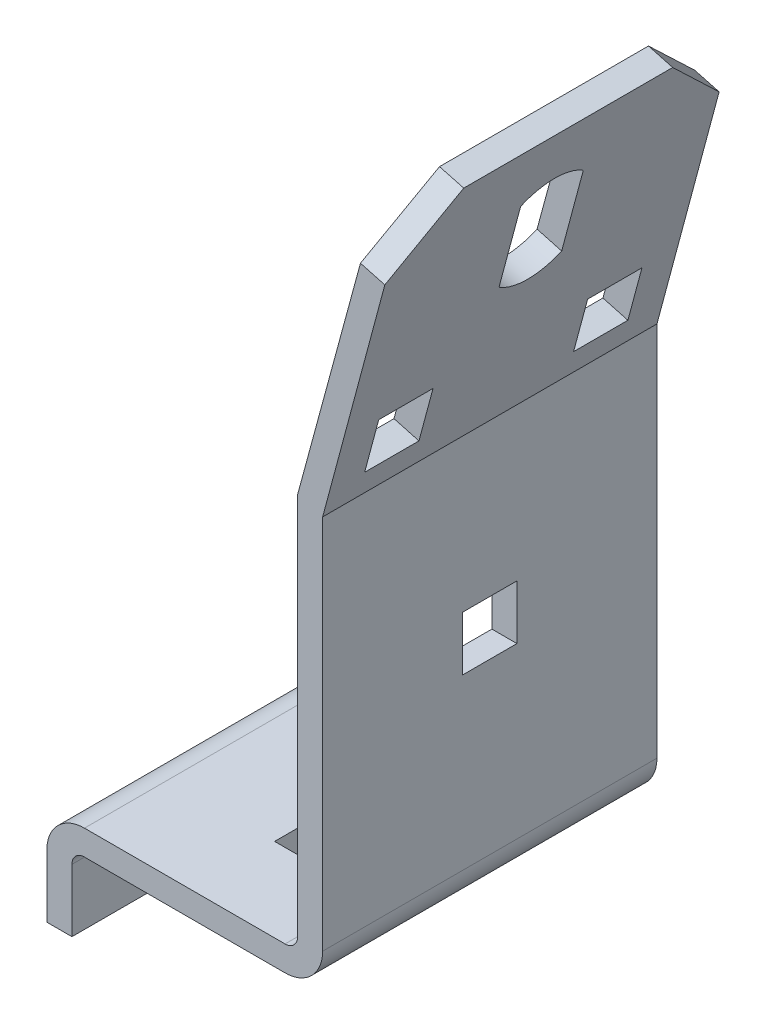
ISO-10303-21;
HEADER;
FILE_DESCRIPTION(('STEP AP214'),'2;1');
FILE_NAME('part.step','',(''),(''),'','','');
FILE_SCHEMA(('AUTOMOTIVE_DESIGN { 1 0 10303 214 1 1 1 1 }'));
ENDSEC;
DATA;
#1=APPLICATION_CONTEXT('core data for automotive mechanical design processes');
#2=APPLICATION_PROTOCOL_DEFINITION('international standard','automotive_design',2000,#1);
#3=PRODUCT_CONTEXT('',#1,'mechanical');
#4=PRODUCT('Part','Part','',(#3));
#5=PRODUCT_RELATED_PRODUCT_CATEGORY('part','',(#4));
#6=PRODUCT_DEFINITION_FORMATION('','',#4);
#7=PRODUCT_DEFINITION_CONTEXT('part definition',#1,'design');
#8=PRODUCT_DEFINITION('design','',#6,#7);
#9=PRODUCT_DEFINITION_SHAPE('','',#8);
#10=(LENGTH_UNIT() NAMED_UNIT(*) SI_UNIT(.MILLI.,.METRE.));
#11=(NAMED_UNIT(*) PLANE_ANGLE_UNIT() SI_UNIT($,.RADIAN.));
#12=(NAMED_UNIT(*) SI_UNIT($,.STERADIAN.) SOLID_ANGLE_UNIT());
#13=UNCERTAINTY_MEASURE_WITH_UNIT(LENGTH_MEASURE(1.E-05),#10,'distance_accuracy_value','');
#14=(GEOMETRIC_REPRESENTATION_CONTEXT(3) GLOBAL_UNCERTAINTY_ASSIGNED_CONTEXT((#13)) GLOBAL_UNIT_ASSIGNED_CONTEXT((#10,
#11,#12)) REPRESENTATION_CONTEXT('',''));
#15=CARTESIAN_POINT('',(0.,0.,0.));
#16=DIRECTION('',(0.,0.,1.));
#17=DIRECTION('',(1.,0.,0.));
#18=AXIS2_PLACEMENT_3D('',#15,#16,#17);
#19=CARTESIAN_POINT('',(0.,15.,-80.));
#20=DIRECTION('',(-1.,0.,0.));
#21=DIRECTION('',(0.,0.,1.));
#22=AXIS2_PLACEMENT_3D('',#19,#20,#21);
#23=PLANE('',#22);
#24=DIRECTION('',(0.,-1.,0.));
#25=VECTOR('',#24,1.);
#26=CARTESIAN_POINT('',(0.,15.,0.));
#27=LINE('',#26,#25);
#28=CARTESIAN_POINT('',(0.,15.,0.));
#29=VERTEX_POINT('',#28);
#30=CARTESIAN_POINT('',(0.,0.,0.));
#31=VERTEX_POINT('',#30);
#32=EDGE_CURVE('E409',#29,#31,#27,.T.);
#33=ORIENTED_EDGE('',*,*,#32,.F.);
#34=DIRECTION('',(0.,0.,1.));
#35=VECTOR('',#34,1.);
#36=CARTESIAN_POINT('',(0.,15.,-80.));
#37=LINE('',#36,#35);
#38=CARTESIAN_POINT('',(0.,15.,-80.));
#39=VERTEX_POINT('',#38);
#40=EDGE_CURVE('E446',#39,#29,#37,.T.);
#41=ORIENTED_EDGE('',*,*,#40,.F.);
#42=DIRECTION('',(0.,-1.,0.));
#43=VECTOR('',#42,1.);
#44=CARTESIAN_POINT('',(0.,0.,-80.));
#45=LINE('',#44,#43);
#46=CARTESIAN_POINT('',(0.,0.,-80.));
#47=VERTEX_POINT('',#46);
#48=EDGE_CURVE('E411',#39,#47,#45,.T.);
#49=ORIENTED_EDGE('',*,*,#48,.T.);
#50=DIRECTION('',(0.,0.,1.));
#51=VECTOR('',#50,1.);
#52=CARTESIAN_POINT('',(0.,0.,-80.));
#53=LINE('',#52,#51);
#54=EDGE_CURVE('E445',#47,#31,#53,.T.);
#55=ORIENTED_EDGE('',*,*,#54,.T.);
#56=EDGE_LOOP('',(#33,#41,#49,#55));
#57=FACE_BOUND('',#56,.T.);
#58=ADVANCED_FACE('F34',(#57),#23,.T.);
#59=CARTESIAN_POINT('',(9.,15.,-80.));
#60=DIRECTION('',(0.,0.,1.));
#61=DIRECTION('',(1.,0.,0.));
#62=AXIS2_PLACEMENT_3D('',#59,#60,#61);
#63=CYLINDRICAL_SURFACE('',#62,9.);
#64=CARTESIAN_POINT('',(9.,15.,0.));
#65=DIRECTION('',(0.,0.,1.));
#66=DIRECTION('',(1.,0.,0.));
#67=AXIS2_PLACEMENT_3D('',#64,#65,#66);
#68=CIRCLE('',#67,9.);
#69=CARTESIAN_POINT('',(9.,24.,0.));
#70=VERTEX_POINT('',#69);
#71=EDGE_CURVE('E406',#70,#29,#68,.T.);
#72=ORIENTED_EDGE('',*,*,#71,.F.);
#73=DIRECTION('',(0.,0.,1.));
#74=VECTOR('',#73,1.);
#75=CARTESIAN_POINT('',(9.,24.,-80.));
#76=LINE('',#75,#74);
#77=CARTESIAN_POINT('',(9.,24.,-80.));
#78=VERTEX_POINT('',#77);
#79=EDGE_CURVE('E449',#78,#70,#76,.T.);
#80=ORIENTED_EDGE('',*,*,#79,.F.);
#81=CARTESIAN_POINT('',(9.,15.,-80.));
#82=DIRECTION('',(0.,0.,1.));
#83=DIRECTION('',(1.,0.,0.));
#84=AXIS2_PLACEMENT_3D('',#81,#82,#83);
#85=CIRCLE('',#84,9.);
#86=EDGE_CURVE('E442',#78,#39,#85,.T.);
#87=ORIENTED_EDGE('',*,*,#86,.T.);
#88=ORIENTED_EDGE('',*,*,#40,.T.);
#89=EDGE_LOOP('',(#72,#80,#87,#88));
#90=FACE_BOUND('',#89,.T.);
#91=ADVANCED_FACE('F559',(#90),#63,.T.);
#92=CARTESIAN_POINT('',(12.0000000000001,24.,-80.));
#93=DIRECTION('',(0.,1.,0.));
#94=DIRECTION('',(0.,0.,1.));
#95=AXIS2_PLACEMENT_3D('',#92,#93,#94);
#96=PLANE('',#95);
#97=DIRECTION('',(0.,0.,-1.));
#98=VECTOR('',#97,1.);
#99=CARTESIAN_POINT('',(47.5,24.,-60.));
#100=LINE('',#99,#98);
#101=CARTESIAN_POINT('',(47.5,24.,-20.));
#102=VERTEX_POINT('',#101);
#103=CARTESIAN_POINT('',(47.5,24.,-60.));
#104=VERTEX_POINT('',#103);
#105=EDGE_CURVE('E49',#102,#104,#100,.T.);
#106=ORIENTED_EDGE('',*,*,#105,.F.);
#107=DIRECTION('',(1.,0.,0.));
#108=VECTOR('',#107,1.);
#109=CARTESIAN_POINT('',(47.5,24.,-20.));
#110=LINE('',#109,#108);
#111=CARTESIAN_POINT('',(34.5,24.,-20.));
#112=VERTEX_POINT('',#111);
#113=EDGE_CURVE('E285',#112,#102,#110,.T.);
#114=ORIENTED_EDGE('',*,*,#113,.F.);
#115=DIRECTION('',(0.,0.,1.));
#116=VECTOR('',#115,1.);
#117=CARTESIAN_POINT('',(34.5,24.,-60.));
#118=LINE('',#117,#116);
#119=CARTESIAN_POINT('',(34.5,24.,-60.));
#120=VERTEX_POINT('',#119);
#121=EDGE_CURVE('E269',#120,#112,#118,.T.);
#122=ORIENTED_EDGE('',*,*,#121,.F.);
#123=DIRECTION('',(-1.,0.,0.));
#124=VECTOR('',#123,1.);
#125=CARTESIAN_POINT('',(47.5,24.,-60.));
#126=LINE('',#125,#124);
#127=EDGE_CURVE('E278',#104,#120,#126,.T.);
#128=ORIENTED_EDGE('',*,*,#127,.F.);
#129=EDGE_LOOP('',(#106,#114,#122,#128));
#130=FACE_BOUND('',#129,.T.);
#131=DIRECTION('',(-1.,0.,0.));
#132=VECTOR('',#131,1.);
#133=CARTESIAN_POINT('',(12.0000000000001,24.,0.));
#134=LINE('',#133,#132);
#135=CARTESIAN_POINT('',(57.,24.,0.));
#136=VERTEX_POINT('',#135);
#137=EDGE_CURVE('E403',#136,#70,#134,.T.);
#138=ORIENTED_EDGE('',*,*,#137,.F.);
#139=DIRECTION('',(0.,0.,1.));
#140=VECTOR('',#139,1.);
#141=CARTESIAN_POINT('',(57.,24.,-80.));
#142=LINE('',#141,#140);
#143=CARTESIAN_POINT('',(57.,24.,-80.));
#144=VERTEX_POINT('',#143);
#145=EDGE_CURVE('E451',#144,#136,#142,.T.);
#146=ORIENTED_EDGE('',*,*,#145,.F.);
#147=DIRECTION('',(-1.,0.,0.));
#148=VECTOR('',#147,1.);
#149=CARTESIAN_POINT('',(48.,24.,-80.));
#150=LINE('',#149,#148);
#151=EDGE_CURVE('E440',#144,#78,#150,.T.);
#152=ORIENTED_EDGE('',*,*,#151,.T.);
#153=ORIENTED_EDGE('',*,*,#79,.T.);
#154=EDGE_LOOP('',(#138,#146,#152,#153));
#155=FACE_BOUND('',#154,.T.);
#156=ADVANCED_FACE('F282',(#130,#155),#96,.T.);
#157=CARTESIAN_POINT('',(57.,27.,-80.));
#158=DIRECTION('',(0.,0.,1.));
#159=DIRECTION('',(1.,0.,0.));
#160=AXIS2_PLACEMENT_3D('',#157,#158,#159);
#161=CYLINDRICAL_SURFACE('',#160,3.);
#162=CARTESIAN_POINT('',(57.,27.,0.));
#163=DIRECTION('',(0.,0.,-1.));
#164=DIRECTION('',(1.,0.,0.));
#165=AXIS2_PLACEMENT_3D('',#162,#163,#164);
#166=CIRCLE('',#165,3.);
#167=CARTESIAN_POINT('',(60.,27.,0.));
#168=VERTEX_POINT('',#167);
#169=EDGE_CURVE('E400',#168,#136,#166,.T.);
#170=ORIENTED_EDGE('',*,*,#169,.F.);
#171=DIRECTION('',(0.,0.,1.));
#172=VECTOR('',#171,1.);
#173=CARTESIAN_POINT('',(60.,27.,-80.));
#174=LINE('',#173,#172);
#175=CARTESIAN_POINT('',(60.,27.,-80.));
#176=VERTEX_POINT('',#175);
#177=EDGE_CURVE('E454',#176,#168,#174,.T.);
#178=ORIENTED_EDGE('',*,*,#177,.F.);
#179=CARTESIAN_POINT('',(57.,27.,-80.));
#180=DIRECTION('',(0.,0.,-1.));
#181=DIRECTION('',(1.,0.,0.));
#182=AXIS2_PLACEMENT_3D('',#179,#180,#181);
#183=CIRCLE('',#182,3.);
#184=EDGE_CURVE('E437',#176,#144,#183,.T.);
#185=ORIENTED_EDGE('',*,*,#184,.T.);
#186=ORIENTED_EDGE('',*,*,#145,.T.);
#187=EDGE_LOOP('',(#170,#178,#185,#186));
#188=FACE_BOUND('',#187,.T.);
#189=ADVANCED_FACE('F574',(#188),#161,.F.);
#190=CARTESIAN_POINT('',(60.,30.,-80.));
#191=DIRECTION('',(-1.,0.,0.));
#192=DIRECTION('',(0.,0.,1.));
#193=AXIS2_PLACEMENT_3D('',#190,#191,#192);
#194=PLANE('',#193);
#195=DIRECTION('',(0.,1.,0.));
#196=VECTOR('',#195,1.);
#197=CARTESIAN_POINT('',(60.,80.5,-33.5));
#198=LINE('',#197,#196);
#199=CARTESIAN_POINT('',(60.,67.5,-33.5));
#200=VERTEX_POINT('',#199);
#201=CARTESIAN_POINT('',(60.,80.5,-33.5));
#202=VERTEX_POINT('',#201);
#203=EDGE_CURVE('E292',#200,#202,#198,.T.);
#204=ORIENTED_EDGE('',*,*,#203,.F.);
#205=DIRECTION('',(0.,0.,1.));
#206=VECTOR('',#205,1.);
#207=CARTESIAN_POINT('',(60.,67.5,-33.5));
#208=LINE('',#207,#206);
#209=CARTESIAN_POINT('',(60.,67.5,-46.5));
#210=VERTEX_POINT('',#209);
#211=EDGE_CURVE('E302',#210,#200,#208,.T.);
#212=ORIENTED_EDGE('',*,*,#211,.F.);
#213=DIRECTION('',(0.,-1.,0.));
#214=VECTOR('',#213,1.);
#215=CARTESIAN_POINT('',(60.,80.5,-46.5));
#216=LINE('',#215,#214);
#217=CARTESIAN_POINT('',(60.,80.5,-46.5));
#218=VERTEX_POINT('',#217);
#219=EDGE_CURVE('E299',#218,#210,#216,.T.);
#220=ORIENTED_EDGE('',*,*,#219,.F.);
#221=DIRECTION('',(0.,0.,-1.));
#222=VECTOR('',#221,1.);
#223=CARTESIAN_POINT('',(60.,80.5,-33.5));
#224=LINE('',#223,#222);
#225=EDGE_CURVE('E296',#202,#218,#224,.T.);
#226=ORIENTED_EDGE('',*,*,#225,.F.);
#227=EDGE_LOOP('',(#204,#212,#220,#226));
#228=FACE_BOUND('',#227,.T.);
#229=DIRECTION('',(0.,-1.,0.));
#230=VECTOR('',#229,1.);
#231=CARTESIAN_POINT('',(60.,30.,0.));
#232=LINE('',#231,#230);
#233=CARTESIAN_POINT('',(60.,118.608015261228,0.));
#234=VERTEX_POINT('',#233);
#235=EDGE_CURVE('E397',#234,#168,#232,.T.);
#236=ORIENTED_EDGE('',*,*,#235,.F.);
#237=DIRECTION('',(0.,0.,1.));
#238=VECTOR('',#237,1.);
#239=CARTESIAN_POINT('',(60.,118.608015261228,-80.));
#240=LINE('',#239,#238);
#241=CARTESIAN_POINT('',(60.,118.608015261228,-80.));
#242=VERTEX_POINT('',#241);
#243=EDGE_CURVE('E456',#242,#234,#240,.T.);
#244=ORIENTED_EDGE('',*,*,#243,.F.);
#245=DIRECTION('',(0.,-1.,0.));
#246=VECTOR('',#245,1.);
#247=CARTESIAN_POINT('',(60.,30.,-80.));
#248=LINE('',#247,#246);
#249=EDGE_CURVE('E435',#242,#176,#248,.T.);
#250=ORIENTED_EDGE('',*,*,#249,.T.);
#251=ORIENTED_EDGE('',*,*,#177,.T.);
#252=EDGE_LOOP('',(#236,#244,#250,#251));
#253=FACE_BOUND('',#252,.T.);
#254=ADVANCED_FACE('F577',(#228,#253),#194,.T.);
#255=CARTESIAN_POINT('',(78.9688258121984,188.582536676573,-80.));
#256=DIRECTION('',(-0.965165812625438,0.261638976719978,0.));
#257=DIRECTION('',(-0.261638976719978,-0.965165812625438,0.));
#258=AXIS2_PLACEMENT_3D('',#255,#256,#257);
#259=PLANE('',#258);
#260=DIRECTION('',(0.261638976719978,0.965165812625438,0.));
#261=VECTOR('',#260,1.);
#262=CARTESIAN_POINT('',(64.9711405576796,136.946165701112,-58.5));
#263=LINE('',#262,#261);
#264=CARTESIAN_POINT('',(61.5698338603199,124.399010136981,-58.5));
#265=VERTEX_POINT('',#264);
#266=CARTESIAN_POINT('',(64.9711405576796,136.946165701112,-58.5));
#267=VERTEX_POINT('',#266);
#268=EDGE_CURVE('E308',#265,#267,#263,.T.);
#269=ORIENTED_EDGE('',*,*,#268,.F.);
#270=DIRECTION('',(0.,0.,1.));
#271=VECTOR('',#270,1.);
#272=CARTESIAN_POINT('',(61.5698338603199,124.399010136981,-58.5));
#273=LINE('',#272,#271);
#274=CARTESIAN_POINT('',(61.5698338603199,124.399010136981,-71.5));
#275=VERTEX_POINT('',#274);
#276=EDGE_CURVE('E322',#275,#265,#273,.T.);
#277=ORIENTED_EDGE('',*,*,#276,.F.);
#278=DIRECTION('',(-0.261638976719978,-0.965165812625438,0.));
#279=VECTOR('',#278,1.);
#280=CARTESIAN_POINT('',(64.9711405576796,136.946165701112,-71.5));
#281=LINE('',#280,#279);
#282=CARTESIAN_POINT('',(64.9711405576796,136.946165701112,-71.5));
#283=VERTEX_POINT('',#282);
#284=EDGE_CURVE('E319',#283,#275,#281,.T.);
#285=ORIENTED_EDGE('',*,*,#284,.F.);
#286=DIRECTION('',(0.,0.,-1.));
#287=VECTOR('',#286,1.);
#288=CARTESIAN_POINT('',(64.9711405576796,136.946165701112,-58.5));
#289=LINE('',#288,#287);
#290=EDGE_CURVE('E316',#267,#283,#289,.T.);
#291=ORIENTED_EDGE('',*,*,#290,.F.);
#292=EDGE_LOOP('',(#269,#277,#285,#291));
#293=FACE_BOUND('',#292,.T.);
#294=DIRECTION('',(0.261638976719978,0.965165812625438,0.));
#295=VECTOR('',#294,1.);
#296=CARTESIAN_POINT('',(64.9711405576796,136.946165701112,-8.5));
#297=LINE('',#296,#295);
#298=CARTESIAN_POINT('',(61.5698338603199,124.399010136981,-8.5));
#299=VERTEX_POINT('',#298);
#300=CARTESIAN_POINT('',(64.9711405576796,136.946165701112,-8.49999999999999));
#301=VERTEX_POINT('',#300);
#302=EDGE_CURVE('E328',#299,#301,#297,.T.);
#303=ORIENTED_EDGE('',*,*,#302,.F.);
#304=DIRECTION('',(0.,0.,1.));
#305=VECTOR('',#304,1.);
#306=CARTESIAN_POINT('',(61.5698338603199,124.399010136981,-8.5));
#307=LINE('',#306,#305);
#308=CARTESIAN_POINT('',(61.5698338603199,124.399010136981,-21.5));
#309=VERTEX_POINT('',#308);
#310=EDGE_CURVE('E342',#309,#299,#307,.T.);
#311=ORIENTED_EDGE('',*,*,#310,.F.);
#312=DIRECTION('',(-0.261638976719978,-0.965165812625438,0.));
#313=VECTOR('',#312,1.);
#314=CARTESIAN_POINT('',(64.9711405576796,136.946165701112,-21.5));
#315=LINE('',#314,#313);
#316=CARTESIAN_POINT('',(64.9711405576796,136.946165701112,-21.5));
#317=VERTEX_POINT('',#316);
#318=EDGE_CURVE('E339',#317,#309,#315,.T.);
#319=ORIENTED_EDGE('',*,*,#318,.F.);
#320=DIRECTION('',(0.,0.,-1.));
#321=VECTOR('',#320,1.);
#322=CARTESIAN_POINT('',(64.9711405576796,136.946165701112,-8.5));
#323=LINE('',#322,#321);
#324=EDGE_CURVE('E336',#301,#317,#323,.T.);
#325=ORIENTED_EDGE('',*,*,#324,.F.);
#326=EDGE_LOOP('',(#303,#311,#319,#325));
#327=FACE_BOUND('',#326,.T.);
#328=CARTESIAN_POINT('',(72.427851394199,164.453391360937,-40.));
#329=DIRECTION('',(-0.965165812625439,0.261638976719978,0.));
#330=DIRECTION('',(-0.261638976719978,-0.965165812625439,0.));
#331=AXIS2_PLACEMENT_3D('',#328,#329,#330);
#332=CIRCLE('',#331,12.5);
#333=CARTESIAN_POINT('',(75.0442411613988,174.105049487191,-32.5));
#334=VERTEX_POINT('',#333);
#335=CARTESIAN_POINT('',(75.0442411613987,174.105049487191,-47.5));
#336=VERTEX_POINT('',#335);
#337=EDGE_CURVE('E348',#334,#336,#332,.T.);
#338=ORIENTED_EDGE('',*,*,#337,.F.);
#339=DIRECTION('',(0.261638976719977,0.965165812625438,0.));
#340=VECTOR('',#339,1.);
#341=CARTESIAN_POINT('',(75.0442411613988,174.105049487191,-32.5));
#342=LINE('',#341,#340);
#343=CARTESIAN_POINT('',(69.8114616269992,154.801733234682,-32.5));
#344=VERTEX_POINT('',#343);
#345=EDGE_CURVE('E362',#344,#334,#342,.T.);
#346=ORIENTED_EDGE('',*,*,#345,.F.);
#347=CARTESIAN_POINT('',(72.427851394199,164.453391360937,-40.));
#348=DIRECTION('',(-0.965165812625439,0.261638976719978,0.));
#349=DIRECTION('',(-0.261638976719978,-0.965165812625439,0.));
#350=AXIS2_PLACEMENT_3D('',#347,#348,#349);
#351=CIRCLE('',#350,12.5);
#352=CARTESIAN_POINT('',(69.8114616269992,154.801733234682,-47.5));
#353=VERTEX_POINT('',#352);
#354=EDGE_CURVE('E359',#353,#344,#351,.T.);
#355=ORIENTED_EDGE('',*,*,#354,.F.);
#356=DIRECTION('',(-0.261638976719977,-0.965165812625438,0.));
#357=VECTOR('',#356,1.);
#358=CARTESIAN_POINT('',(75.0442411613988,174.105049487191,-47.5));
#359=LINE('',#358,#357);
#360=EDGE_CURVE('E356',#336,#353,#359,.T.);
#361=ORIENTED_EDGE('',*,*,#360,.F.);
#362=EDGE_LOOP('',(#338,#346,#355,#361));
#363=FACE_BOUND('',#362,.T.);
#364=DIRECTION('',(0.,0.,1.));
#365=VECTOR('',#364,1.);
#366=CARTESIAN_POINT('',(78.9688258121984,188.582536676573,-80.));
#367=LINE('',#366,#365);
#368=CARTESIAN_POINT('',(78.9688258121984,188.582536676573,-65.));
#369=VERTEX_POINT('',#368);
#370=CARTESIAN_POINT('',(78.9688258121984,188.582536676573,-15.));
#371=VERTEX_POINT('',#370);
#372=EDGE_CURVE('E459',#369,#371,#367,.T.);
#373=ORIENTED_EDGE('',*,*,#372,.F.);
#374=DIRECTION('',(-0.185007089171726,-0.682476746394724,-0.707105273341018));
#375=VECTOR('',#374,1.);
#376=CARTESIAN_POINT('',(77.0065334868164,181.343793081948,-72.4999680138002));
#377=LINE('',#376,#375);
#378=CARTESIAN_POINT('',(75.0442244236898,174.104987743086,-80.));
#379=VERTEX_POINT('',#378);
#380=EDGE_CURVE('E492',#369,#379,#377,.T.);
#381=ORIENTED_EDGE('',*,*,#380,.T.);
#382=DIRECTION('',(-0.261638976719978,-0.965165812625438,0.));
#383=VECTOR('',#382,1.);
#384=CARTESIAN_POINT('',(78.9688258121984,188.582536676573,-80.));
#385=LINE('',#384,#383);
#386=EDGE_CURVE('E433',#379,#242,#385,.T.);
#387=ORIENTED_EDGE('',*,*,#386,.T.);
#388=ORIENTED_EDGE('',*,*,#243,.T.);
#389=DIRECTION('',(-0.261638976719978,-0.965165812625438,0.));
#390=VECTOR('',#389,1.);
#391=CARTESIAN_POINT('',(78.9688258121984,188.582536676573,0.));
#392=LINE('',#391,#390);
#393=CARTESIAN_POINT('',(75.0442244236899,174.104987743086,0.));
#394=VERTEX_POINT('',#393);
#395=EDGE_CURVE('E395',#394,#234,#392,.T.);
#396=ORIENTED_EDGE('',*,*,#395,.F.);
#397=DIRECTION('',(-0.185007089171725,-0.682476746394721,0.707105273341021));
#398=VECTOR('',#397,1.);
#399=CARTESIAN_POINT('',(87.4720925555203,219.950425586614,-47.4998613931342));
#400=LINE('',#399,#398);
#401=EDGE_CURVE('E481',#394,#371,#400,.F.);
#402=ORIENTED_EDGE('',*,*,#401,.T.);
#403=EDGE_LOOP('',(#373,#381,#387,#388,#396,#402));
#404=FACE_BOUND('',#403,.T.);
#405=ADVANCED_FACE('F581',(#293,#327,#363,#404),#259,.T.);
#406=CARTESIAN_POINT('',(84.7643807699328,187.029622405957,-80.));
#407=DIRECTION('',(0.258819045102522,0.965925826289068,0.));
#408=DIRECTION('',(-0.965925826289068,0.258819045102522,0.));
#409=AXIS2_PLACEMENT_3D('',#406,#407,#408);
#410=PLANE('',#409);
#411=DIRECTION('',(0.,0.,1.));
#412=VECTOR('',#411,1.);
#413=CARTESIAN_POINT('',(84.7643807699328,187.029622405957,-80.));
#414=LINE('',#413,#412);
#415=CARTESIAN_POINT('',(84.7643807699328,187.029622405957,-65.));
#416=VERTEX_POINT('',#415);
#417=CARTESIAN_POINT('',(84.7643807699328,187.029622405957,-15.0000000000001));
#418=VERTEX_POINT('',#417);
#419=EDGE_CURVE('E461',#416,#418,#414,.T.);
#420=ORIENTED_EDGE('',*,*,#419,.F.);
#421=DIRECTION('',(-0.965925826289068,0.258819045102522,0.));
#422=VECTOR('',#421,1.);
#423=CARTESIAN_POINT('',(78.9688258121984,188.582536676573,-65.));
#424=LINE('',#423,#422);
#425=EDGE_CURVE('E489',#416,#369,#424,.T.);
#426=ORIENTED_EDGE('',*,*,#425,.T.);
#427=ORIENTED_EDGE('',*,*,#372,.T.);
#428=DIRECTION('',(0.965925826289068,-0.258819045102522,0.));
#429=VECTOR('',#428,1.);
#430=CARTESIAN_POINT('',(84.7643807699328,187.029622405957,-15.));
#431=LINE('',#430,#429);
#432=EDGE_CURVE('E484',#371,#418,#431,.T.);
#433=ORIENTED_EDGE('',*,*,#432,.T.);
#434=EDGE_LOOP('',(#420,#426,#427,#433));
#435=FACE_BOUND('',#434,.T.);
#436=ADVANCED_FACE('F585',(#435),#410,.T.);
#437=CARTESIAN_POINT('',(66.,117.,-80.));
#438=DIRECTION('',(0.965925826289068,-0.258819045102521,0.));
#439=DIRECTION('',(0.258819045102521,0.965925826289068,0.));
#440=AXIS2_PLACEMENT_3D('',#437,#438,#439);
#441=PLANE('',#440);
#442=DIRECTION('',(-0.258819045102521,-0.965925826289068,0.));
#443=VECTOR('',#442,1.);
#444=CARTESIAN_POINT('',(66.,117.,-58.5));
#445=LINE('',#444,#443);
#446=CARTESIAN_POINT('',(70.9129674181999,135.335444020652,-58.5));
#447=VERTEX_POINT('',#446);
#448=CARTESIAN_POINT('',(67.5483054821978,122.7783547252,-58.5));
#449=VERTEX_POINT('',#448);
#450=EDGE_CURVE('E523',#447,#449,#445,.T.);
#451=ORIENTED_EDGE('',*,*,#450,.F.);
#452=DIRECTION('',(0.,0.,1.));
#453=VECTOR('',#452,1.);
#454=CARTESIAN_POINT('',(70.9129674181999,135.335444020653,-80.));
#455=LINE('',#454,#453);
#456=CARTESIAN_POINT('',(70.9129674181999,135.335444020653,-71.5));
#457=VERTEX_POINT('',#456);
#458=EDGE_CURVE('E516',#457,#447,#455,.T.);
#459=ORIENTED_EDGE('',*,*,#458,.F.);
#460=DIRECTION('',(0.258819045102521,0.965925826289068,0.));
#461=VECTOR('',#460,1.);
#462=CARTESIAN_POINT('',(66.,117.,-71.5));
#463=LINE('',#462,#461);
#464=CARTESIAN_POINT('',(67.5483054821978,122.7783547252,-71.5));
#465=VERTEX_POINT('',#464);
#466=EDGE_CURVE('E518',#465,#457,#463,.T.);
#467=ORIENTED_EDGE('',*,*,#466,.F.);
#468=DIRECTION('',(0.,0.,-1.));
#469=VECTOR('',#468,1.);
#470=CARTESIAN_POINT('',(67.5483054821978,122.7783547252,-80.));
#471=LINE('',#470,#469);
#472=EDGE_CURVE('E521',#449,#465,#471,.T.);
#473=ORIENTED_EDGE('',*,*,#472,.F.);
#474=EDGE_LOOP('',(#451,#459,#467,#473));
#475=FACE_BOUND('',#474,.T.);
#476=DIRECTION('',(-0.258819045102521,-0.965925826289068,0.));
#477=VECTOR('',#476,1.);
#478=CARTESIAN_POINT('',(66.,117.,-8.49999999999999));
#479=LINE('',#478,#477);
#480=CARTESIAN_POINT('',(70.9129674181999,135.335444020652,-8.5));
#481=VERTEX_POINT('',#480);
#482=CARTESIAN_POINT('',(67.5483054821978,122.7783547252,-8.5));
#483=VERTEX_POINT('',#482);
#484=EDGE_CURVE('E514',#481,#483,#479,.T.);
#485=ORIENTED_EDGE('',*,*,#484,.F.);
#486=DIRECTION('',(0.,0.,1.));
#487=VECTOR('',#486,1.);
#488=CARTESIAN_POINT('',(70.9129674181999,135.335444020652,-80.));
#489=LINE('',#488,#487);
#490=CARTESIAN_POINT('',(70.9129674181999,135.335444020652,-21.5));
#491=VERTEX_POINT('',#490);
#492=EDGE_CURVE('E507',#491,#481,#489,.T.);
#493=ORIENTED_EDGE('',*,*,#492,.F.);
#494=DIRECTION('',(0.258819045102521,0.965925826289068,0.));
#495=VECTOR('',#494,1.);
#496=CARTESIAN_POINT('',(66.,117.,-21.5));
#497=LINE('',#496,#495);
#498=CARTESIAN_POINT('',(67.5483054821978,122.7783547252,-21.5));
#499=VERTEX_POINT('',#498);
#500=EDGE_CURVE('E509',#499,#491,#497,.T.);
#501=ORIENTED_EDGE('',*,*,#500,.F.);
#502=DIRECTION('',(0.,0.,-1.));
#503=VECTOR('',#502,1.);
#504=CARTESIAN_POINT('',(67.5483054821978,122.7783547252,-80.));
#505=LINE('',#504,#503);
#506=EDGE_CURVE('E512',#483,#499,#505,.T.);
#507=ORIENTED_EDGE('',*,*,#506,.F.);
#508=EDGE_LOOP('',(#485,#493,#501,#507));
#509=FACE_BOUND('',#508,.T.);
#510=CARTESIAN_POINT('',(78.2893416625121,162.864447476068,-40.));
#511=DIRECTION('',(0.965925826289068,-0.258819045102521,0.));
#512=DIRECTION('',(0.258819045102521,0.965925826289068,0.));
#513=AXIS2_PLACEMENT_3D('',#510,#511,#512);
#514=ELLIPSE('',#513,12.5000533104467,12.5);
#515=CARTESIAN_POINT('',(80.8775431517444,172.523746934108,-47.5));
#516=VERTEX_POINT('',#515);
#517=CARTESIAN_POINT('',(80.8775431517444,172.523746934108,-32.5));
#518=VERTEX_POINT('',#517);
#519=EDGE_CURVE('E505',#516,#518,#514,.T.);
#520=ORIENTED_EDGE('',*,*,#519,.F.);
#521=DIRECTION('',(0.258819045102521,0.965925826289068,0.));
#522=VECTOR('',#521,1.);
#523=CARTESIAN_POINT('',(66.,117.,-47.5));
#524=LINE('',#523,#522);
#525=CARTESIAN_POINT('',(75.7011401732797,153.205148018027,-47.5));
#526=VERTEX_POINT('',#525);
#527=EDGE_CURVE('E498',#526,#516,#524,.T.);
#528=ORIENTED_EDGE('',*,*,#527,.F.);
#529=CARTESIAN_POINT('',(78.2893416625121,162.864447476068,-40.));
#530=DIRECTION('',(0.965925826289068,-0.258819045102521,0.));
#531=DIRECTION('',(0.258819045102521,0.965925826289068,0.));
#532=AXIS2_PLACEMENT_3D('',#529,#530,#531);
#533=ELLIPSE('',#532,12.5000533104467,12.5);
#534=CARTESIAN_POINT('',(75.7011401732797,153.205148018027,-32.5));
#535=VERTEX_POINT('',#534);
#536=EDGE_CURVE('E500',#535,#526,#533,.T.);
#537=ORIENTED_EDGE('',*,*,#536,.F.);
#538=DIRECTION('',(-0.258819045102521,-0.965925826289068,0.));
#539=VECTOR('',#538,1.);
#540=CARTESIAN_POINT('',(66.,117.,-32.5));
#541=LINE('',#540,#539);
#542=EDGE_CURVE('E503',#518,#535,#541,.T.);
#543=ORIENTED_EDGE('',*,*,#542,.F.);
#544=EDGE_LOOP('',(#520,#528,#537,#543));
#545=FACE_BOUND('',#544,.T.);
#546=DIRECTION('',(0.258819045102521,0.965925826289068,0.));
#547=VECTOR('',#546,1.);
#548=CARTESIAN_POINT('',(66.,117.,-80.));
#549=LINE('',#548,#547);
#550=CARTESIAN_POINT('',(66.,117.,-80.));
#551=VERTEX_POINT('',#550);
#552=CARTESIAN_POINT('',(80.882095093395,172.540735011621,-80.));
#553=VERTEX_POINT('',#552);
#554=EDGE_CURVE('E430',#551,#553,#549,.T.);
#555=ORIENTED_EDGE('',*,*,#554,.T.);
#556=DIRECTION('',(0.18301270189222,0.683012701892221,0.707106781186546));
#557=VECTOR('',#556,1.);
#558=CARTESIAN_POINT('',(73.4410475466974,144.770367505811,-108.75));
#559=LINE('',#558,#557);
#560=EDGE_CURVE('E496',#553,#416,#559,.T.);
#561=ORIENTED_EDGE('',*,*,#560,.T.);
#562=ORIENTED_EDGE('',*,*,#419,.T.);
#563=DIRECTION('',(0.183012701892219,0.683012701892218,-0.707106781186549));
#564=VECTOR('',#563,1.);
#565=CARTESIAN_POINT('',(83.7938093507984,183.407400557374,-11.2500000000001));
#566=LINE('',#565,#564);
#567=CARTESIAN_POINT('',(80.882095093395,172.540735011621,0.));
#568=VERTEX_POINT('',#567);
#569=EDGE_CURVE('E487',#418,#568,#566,.F.);
#570=ORIENTED_EDGE('',*,*,#569,.T.);
#571=DIRECTION('',(0.258819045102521,0.965925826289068,0.));
#572=VECTOR('',#571,1.);
#573=CARTESIAN_POINT('',(66.,117.,0.));
#574=LINE('',#573,#572);
#575=CARTESIAN_POINT('',(66.,117.,0.));
#576=VERTEX_POINT('',#575);
#577=EDGE_CURVE('E392',#576,#568,#574,.T.);
#578=ORIENTED_EDGE('',*,*,#577,.F.);
#579=DIRECTION('',(0.,0.,1.));
#580=VECTOR('',#579,1.);
#581=CARTESIAN_POINT('',(66.,117.,-80.));
#582=LINE('',#581,#580);
#583=EDGE_CURVE('E463',#551,#576,#582,.T.);
#584=ORIENTED_EDGE('',*,*,#583,.F.);
#585=EDGE_LOOP('',(#555,#561,#562,#570,#578,#584));
#586=FACE_BOUND('',#585,.T.);
#587=ADVANCED_FACE('F589',(#475,#509,#545,#586),#441,.T.);
#588=CARTESIAN_POINT('',(66.,30.0000000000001,-80.));
#589=DIRECTION('',(1.,0.,0.));
#590=DIRECTION('',(0.,0.,-1.));
#591=AXIS2_PLACEMENT_3D('',#588,#589,#590);
#592=PLANE('',#591);
#593=DIRECTION('',(0.,-1.,0.));
#594=VECTOR('',#593,1.);
#595=CARTESIAN_POINT('',(66.,30.0000000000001,-33.5));
#596=LINE('',#595,#594);
#597=CARTESIAN_POINT('',(66.,80.5,-33.5));
#598=VERTEX_POINT('',#597);
#599=CARTESIAN_POINT('',(66.,67.5,-33.5));
#600=VERTEX_POINT('',#599);
#601=EDGE_CURVE('E532',#598,#600,#596,.T.);
#602=ORIENTED_EDGE('',*,*,#601,.F.);
#603=DIRECTION('',(0.,0.,1.));
#604=VECTOR('',#603,1.);
#605=CARTESIAN_POINT('',(66.,80.5,-80.));
#606=LINE('',#605,#604);
#607=CARTESIAN_POINT('',(66.,80.5,-46.5));
#608=VERTEX_POINT('',#607);
#609=EDGE_CURVE('E525',#608,#598,#606,.T.);
#610=ORIENTED_EDGE('',*,*,#609,.F.);
#611=DIRECTION('',(0.,1.,0.));
#612=VECTOR('',#611,1.);
#613=CARTESIAN_POINT('',(66.,30.0000000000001,-46.5));
#614=LINE('',#613,#612);
#615=CARTESIAN_POINT('',(66.,67.5,-46.5));
#616=VERTEX_POINT('',#615);
#617=EDGE_CURVE('E527',#616,#608,#614,.T.);
#618=ORIENTED_EDGE('',*,*,#617,.F.);
#619=DIRECTION('',(0.,0.,-1.));
#620=VECTOR('',#619,1.);
#621=CARTESIAN_POINT('',(66.,67.5,-80.));
#622=LINE('',#621,#620);
#623=EDGE_CURVE('E530',#600,#616,#622,.T.);
#624=ORIENTED_EDGE('',*,*,#623,.F.);
#625=EDGE_LOOP('',(#602,#610,#618,#624));
#626=FACE_BOUND('',#625,.T.);
#627=DIRECTION('',(0.,1.,0.));
#628=VECTOR('',#627,1.);
#629=CARTESIAN_POINT('',(66.,30.0000000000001,0.));
#630=LINE('',#629,#628);
#631=CARTESIAN_POINT('',(66.,27.,0.));
#632=VERTEX_POINT('',#631);
#633=EDGE_CURVE('E389',#632,#576,#630,.T.);
#634=ORIENTED_EDGE('',*,*,#633,.F.);
#635=DIRECTION('',(0.,0.,1.));
#636=VECTOR('',#635,1.);
#637=CARTESIAN_POINT('',(66.,27.,-80.));
#638=LINE('',#637,#636);
#639=CARTESIAN_POINT('',(66.,27.,-80.));
#640=VERTEX_POINT('',#639);
#641=EDGE_CURVE('E465',#640,#632,#638,.T.);
#642=ORIENTED_EDGE('',*,*,#641,.F.);
#643=DIRECTION('',(0.,1.,0.));
#644=VECTOR('',#643,1.);
#645=CARTESIAN_POINT('',(66.,30.0000000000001,-80.));
#646=LINE('',#645,#644);
#647=EDGE_CURVE('E428',#640,#551,#646,.T.);
#648=ORIENTED_EDGE('',*,*,#647,.T.);
#649=ORIENTED_EDGE('',*,*,#583,.T.);
#650=EDGE_LOOP('',(#634,#642,#648,#649));
#651=FACE_BOUND('',#650,.T.);
#652=ADVANCED_FACE('F593',(#626,#651),#592,.T.);
#653=CARTESIAN_POINT('',(57.,27.,-80.));
#654=DIRECTION('',(0.,0.,1.));
#655=DIRECTION('',(1.,0.,0.));
#656=AXIS2_PLACEMENT_3D('',#653,#654,#655);
#657=CYLINDRICAL_SURFACE('',#656,9.);
#658=CARTESIAN_POINT('',(57.,27.,0.));
#659=DIRECTION('',(0.,0.,1.));
#660=DIRECTION('',(1.,0.,0.));
#661=AXIS2_PLACEMENT_3D('',#658,#659,#660);
#662=CIRCLE('',#661,9.);
#663=CARTESIAN_POINT('',(57.,18.,0.));
#664=VERTEX_POINT('',#663);
#665=EDGE_CURVE('E386',#664,#632,#662,.T.);
#666=ORIENTED_EDGE('',*,*,#665,.F.);
#667=DIRECTION('',(0.,0.,1.));
#668=VECTOR('',#667,1.);
#669=CARTESIAN_POINT('',(57.,18.,-80.));
#670=LINE('',#669,#668);
#671=CARTESIAN_POINT('',(57.,18.,-80.));
#672=VERTEX_POINT('',#671);
#673=EDGE_CURVE('E468',#672,#664,#670,.T.);
#674=ORIENTED_EDGE('',*,*,#673,.F.);
#675=CARTESIAN_POINT('',(57.,27.,-80.));
#676=DIRECTION('',(0.,0.,1.));
#677=DIRECTION('',(1.,0.,0.));
#678=AXIS2_PLACEMENT_3D('',#675,#676,#677);
#679=CIRCLE('',#678,9.);
#680=EDGE_CURVE('E425',#672,#640,#679,.T.);
#681=ORIENTED_EDGE('',*,*,#680,.T.);
#682=ORIENTED_EDGE('',*,*,#641,.T.);
#683=EDGE_LOOP('',(#666,#674,#681,#682));
#684=FACE_BOUND('',#683,.T.);
#685=ADVANCED_FACE('F597',(#684),#657,.T.);
#686=CARTESIAN_POINT('',(9.,18.,-80.));
#687=DIRECTION('',(0.,-1.,0.));
#688=DIRECTION('',(1.,0.,0.));
#689=AXIS2_PLACEMENT_3D('',#686,#687,#688);
#690=PLANE('',#689);
#691=DIRECTION('',(0.,0.,1.));
#692=VECTOR('',#691,1.);
#693=CARTESIAN_POINT('',(47.5,18.,-80.));
#694=LINE('',#693,#692);
#695=CARTESIAN_POINT('',(47.5,18.,-60.));
#696=VERTEX_POINT('',#695);
#697=CARTESIAN_POINT('',(47.5,18.,-20.));
#698=VERTEX_POINT('',#697);
#699=EDGE_CURVE('E12',#696,#698,#694,.T.);
#700=ORIENTED_EDGE('',*,*,#699,.F.);
#701=DIRECTION('',(1.,0.,0.));
#702=VECTOR('',#701,1.);
#703=CARTESIAN_POINT('',(9.,18.,-60.));
#704=LINE('',#703,#702);
#705=CARTESIAN_POINT('',(34.5,18.,-60.));
#706=VERTEX_POINT('',#705);
#707=EDGE_CURVE('E534',#706,#696,#704,.T.);
#708=ORIENTED_EDGE('',*,*,#707,.F.);
#709=DIRECTION('',(0.,0.,-1.));
#710=VECTOR('',#709,1.);
#711=CARTESIAN_POINT('',(34.5,18.,-80.));
#712=LINE('',#711,#710);
#713=CARTESIAN_POINT('',(34.5,18.,-20.));
#714=VERTEX_POINT('',#713);
#715=EDGE_CURVE('E272',#714,#706,#712,.T.);
#716=ORIENTED_EDGE('',*,*,#715,.F.);
#717=DIRECTION('',(-1.,0.,0.));
#718=VECTOR('',#717,1.);
#719=CARTESIAN_POINT('',(8.99999999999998,18.,-20.));
#720=LINE('',#719,#718);
#721=EDGE_CURVE('E42',#698,#714,#720,.T.);
#722=ORIENTED_EDGE('',*,*,#721,.F.);
#723=EDGE_LOOP('',(#700,#708,#716,#722));
#724=FACE_BOUND('',#723,.T.);
#725=DIRECTION('',(1.,0.,0.));
#726=VECTOR('',#725,1.);
#727=CARTESIAN_POINT('',(9.,18.,0.));
#728=LINE('',#727,#726);
#729=CARTESIAN_POINT('',(9.,18.,0.));
#730=VERTEX_POINT('',#729);
#731=EDGE_CURVE('E383',#730,#664,#728,.T.);
#732=ORIENTED_EDGE('',*,*,#731,.F.);
#733=DIRECTION('',(0.,0.,1.));
#734=VECTOR('',#733,1.);
#735=CARTESIAN_POINT('',(9.,18.,-80.));
#736=LINE('',#735,#734);
#737=CARTESIAN_POINT('',(9.,18.,-80.));
#738=VERTEX_POINT('',#737);
#739=EDGE_CURVE('E470',#738,#730,#736,.T.);
#740=ORIENTED_EDGE('',*,*,#739,.F.);
#741=DIRECTION('',(1.,0.,0.));
#742=VECTOR('',#741,1.);
#743=CARTESIAN_POINT('',(9.,18.,-80.));
#744=LINE('',#743,#742);
#745=EDGE_CURVE('E422',#738,#672,#744,.T.);
#746=ORIENTED_EDGE('',*,*,#745,.T.);
#747=ORIENTED_EDGE('',*,*,#673,.T.);
#748=EDGE_LOOP('',(#732,#740,#746,#747));
#749=FACE_BOUND('',#748,.T.);
#750=ADVANCED_FACE('F542',(#724,#749),#690,.T.);
#751=CARTESIAN_POINT('',(9.,15.,-80.));
#752=DIRECTION('',(0.,0.,1.));
#753=DIRECTION('',(1.,0.,0.));
#754=AXIS2_PLACEMENT_3D('',#751,#752,#753);
#755=CYLINDRICAL_SURFACE('',#754,2.99999999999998);
#756=CARTESIAN_POINT('',(9.,15.,0.));
#757=DIRECTION('',(0.,0.,-1.));
#758=DIRECTION('',(1.,0.,0.));
#759=AXIS2_PLACEMENT_3D('',#756,#757,#758);
#760=CIRCLE('',#759,2.99999999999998);
#761=CARTESIAN_POINT('',(6.,15.,0.));
#762=VERTEX_POINT('',#761);
#763=EDGE_CURVE('E380',#762,#730,#760,.T.);
#764=ORIENTED_EDGE('',*,*,#763,.F.);
#765=DIRECTION('',(0.,0.,1.));
#766=VECTOR('',#765,1.);
#767=CARTESIAN_POINT('',(6.,15.,-80.));
#768=LINE('',#767,#766);
#769=CARTESIAN_POINT('',(6.,15.,-80.));
#770=VERTEX_POINT('',#769);
#771=EDGE_CURVE('E472',#770,#762,#768,.T.);
#772=ORIENTED_EDGE('',*,*,#771,.F.);
#773=CARTESIAN_POINT('',(9.,15.,-80.));
#774=DIRECTION('',(0.,0.,-1.));
#775=DIRECTION('',(1.,0.,0.));
#776=AXIS2_PLACEMENT_3D('',#773,#774,#775);
#777=CIRCLE('',#776,2.99999999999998);
#778=EDGE_CURVE('E419',#770,#738,#777,.T.);
#779=ORIENTED_EDGE('',*,*,#778,.T.);
#780=ORIENTED_EDGE('',*,*,#739,.T.);
#781=EDGE_LOOP('',(#764,#772,#779,#780));
#782=FACE_BOUND('',#781,.T.);
#783=ADVANCED_FACE('F604',(#782),#755,.F.);
#784=CARTESIAN_POINT('',(6.,15.,-80.));
#785=DIRECTION('',(1.,0.,0.));
#786=DIRECTION('',(0.,1.,0.));
#787=AXIS2_PLACEMENT_3D('',#784,#785,#786);
#788=PLANE('',#787);
#789=DIRECTION('',(0.,1.,0.));
#790=VECTOR('',#789,1.);
#791=CARTESIAN_POINT('',(6.,15.,0.));
#792=LINE('',#791,#790);
#793=CARTESIAN_POINT('',(6.,0.,0.));
#794=VERTEX_POINT('',#793);
#795=EDGE_CURVE('E377',#794,#762,#792,.T.);
#796=ORIENTED_EDGE('',*,*,#795,.F.);
#797=DIRECTION('',(0.,0.,1.));
#798=VECTOR('',#797,1.);
#799=CARTESIAN_POINT('',(6.,0.,-80.));
#800=LINE('',#799,#798);
#801=CARTESIAN_POINT('',(6.,0.,-80.));
#802=VERTEX_POINT('',#801);
#803=EDGE_CURVE('E474',#802,#794,#800,.T.);
#804=ORIENTED_EDGE('',*,*,#803,.F.);
#805=DIRECTION('',(0.,1.,0.));
#806=VECTOR('',#805,1.);
#807=CARTESIAN_POINT('',(6.,0.,-80.));
#808=LINE('',#807,#806);
#809=EDGE_CURVE('E417',#802,#770,#808,.T.);
#810=ORIENTED_EDGE('',*,*,#809,.T.);
#811=ORIENTED_EDGE('',*,*,#771,.T.);
#812=EDGE_LOOP('',(#796,#804,#810,#811));
#813=FACE_BOUND('',#812,.T.);
#814=ADVANCED_FACE('F606',(#813),#788,.T.);
#815=CARTESIAN_POINT('',(0.,0.,-80.));
#816=DIRECTION('',(0.,-1.,0.));
#817=DIRECTION('',(0.,0.,-1.));
#818=AXIS2_PLACEMENT_3D('',#815,#816,#817);
#819=PLANE('',#818);
#820=DIRECTION('',(1.,0.,0.));
#821=VECTOR('',#820,1.);
#822=CARTESIAN_POINT('',(0.,0.,0.));
#823=LINE('',#822,#821);
#824=EDGE_CURVE('E368',#31,#794,#823,.T.);
#825=ORIENTED_EDGE('',*,*,#824,.F.);
#826=ORIENTED_EDGE('',*,*,#54,.F.);
#827=DIRECTION('',(1.,0.,0.));
#828=VECTOR('',#827,1.);
#829=CARTESIAN_POINT('',(0.,0.,-80.));
#830=LINE('',#829,#828);
#831=EDGE_CURVE('E414',#47,#802,#830,.T.);
#832=ORIENTED_EDGE('',*,*,#831,.T.);
#833=ORIENTED_EDGE('',*,*,#803,.T.);
#834=EDGE_LOOP('',(#825,#826,#832,#833));
#835=FACE_BOUND('',#834,.T.);
#836=ADVANCED_FACE('F36',(#835),#819,.T.);
#837=CARTESIAN_POINT('',(9.,15.,-80.));
#838=DIRECTION('',(0.,0.,1.));
#839=DIRECTION('',(1.,0.,0.));
#840=AXIS2_PLACEMENT_3D('',#837,#838,#839);
#841=PLANE('',#840);
#842=ORIENTED_EDGE('',*,*,#386,.F.);
#843=DIRECTION('',(0.965925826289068,-0.258819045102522,0.));
#844=VECTOR('',#843,1.);
#845=CARTESIAN_POINT('',(80.882095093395,172.540735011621,-80.));
#846=LINE('',#845,#844);
#847=EDGE_CURVE('E494',#379,#553,#846,.T.);
#848=ORIENTED_EDGE('',*,*,#847,.T.);
#849=ORIENTED_EDGE('',*,*,#554,.F.);
#850=ORIENTED_EDGE('',*,*,#647,.F.);
#851=ORIENTED_EDGE('',*,*,#680,.F.);
#852=ORIENTED_EDGE('',*,*,#745,.F.);
#853=ORIENTED_EDGE('',*,*,#778,.F.);
#854=ORIENTED_EDGE('',*,*,#809,.F.);
#855=ORIENTED_EDGE('',*,*,#831,.F.);
#856=ORIENTED_EDGE('',*,*,#48,.F.);
#857=ORIENTED_EDGE('',*,*,#86,.F.);
#858=ORIENTED_EDGE('',*,*,#151,.F.);
#859=ORIENTED_EDGE('',*,*,#184,.F.);
#860=ORIENTED_EDGE('',*,*,#249,.F.);
#861=EDGE_LOOP('',(#842,#848,#849,#850,#851,#852,#853,#854,#855,#856,#857,#858,#859,#860));
#862=FACE_BOUND('',#861,.T.);
#863=ADVANCED_FACE('F569',(#862),#841,.F.);
#864=CARTESIAN_POINT('',(9.,15.,0.));
#865=DIRECTION('',(0.,0.,1.));
#866=DIRECTION('',(1.,0.,0.));
#867=AXIS2_PLACEMENT_3D('',#864,#865,#866);
#868=PLANE('',#867);
#869=ORIENTED_EDGE('',*,*,#577,.T.);
#870=DIRECTION('',(-0.965925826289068,0.258819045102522,0.));
#871=VECTOR('',#870,1.);
#872=CARTESIAN_POINT('',(53.2003710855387,179.958030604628,0.));
#873=LINE('',#872,#871);
#874=EDGE_CURVE('E448',#568,#394,#873,.T.);
#875=ORIENTED_EDGE('',*,*,#874,.T.);
#876=ORIENTED_EDGE('',*,*,#395,.T.);
#877=ORIENTED_EDGE('',*,*,#235,.T.);
#878=ORIENTED_EDGE('',*,*,#169,.T.);
#879=ORIENTED_EDGE('',*,*,#137,.T.);
#880=ORIENTED_EDGE('',*,*,#71,.T.);
#881=ORIENTED_EDGE('',*,*,#32,.T.);
#882=ORIENTED_EDGE('',*,*,#824,.T.);
#883=ORIENTED_EDGE('',*,*,#795,.T.);
#884=ORIENTED_EDGE('',*,*,#763,.T.);
#885=ORIENTED_EDGE('',*,*,#731,.T.);
#886=ORIENTED_EDGE('',*,*,#665,.T.);
#887=ORIENTED_EDGE('',*,*,#633,.T.);
#888=EDGE_LOOP('',(#869,#875,#876,#877,#878,#879,#880,#881,#882,#883,#884,#885,#886,#887));
#889=FACE_BOUND('',#888,.T.);
#890=ADVANCED_FACE('F620',(#889),#868,.T.);
#891=CARTESIAN_POINT('',(53.2003710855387,179.958030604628,0.));
#892=DIRECTION('',(-0.183012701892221,-0.68301270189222,-0.707106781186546));
#893=DIRECTION('',(0.,0.719254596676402,-0.694746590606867));
#894=AXIS2_PLACEMENT_3D('',#891,#892,#893);
#895=PLANE('',#894);
#896=ORIENTED_EDGE('',*,*,#569,.F.);
#897=ORIENTED_EDGE('',*,*,#432,.F.);
#898=ORIENTED_EDGE('',*,*,#401,.F.);
#899=ORIENTED_EDGE('',*,*,#874,.F.);
#900=EDGE_LOOP('',(#896,#897,#898,#899));
#901=FACE_BOUND('',#900,.T.);
#902=ADVANCED_FACE('F650',(#901),#895,.F.);
#903=CARTESIAN_POINT('',(84.7643807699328,187.029622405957,-65.));
#904=DIRECTION('',(0.18301270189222,0.683012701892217,-0.707106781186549));
#905=DIRECTION('',(0.,0.719254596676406,0.694746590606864));
#906=AXIS2_PLACEMENT_3D('',#903,#904,#905);
#907=PLANE('',#906);
#908=ORIENTED_EDGE('',*,*,#560,.F.);
#909=ORIENTED_EDGE('',*,*,#847,.F.);
#910=ORIENTED_EDGE('',*,*,#380,.F.);
#911=ORIENTED_EDGE('',*,*,#425,.F.);
#912=EDGE_LOOP('',(#908,#909,#910,#911));
#913=FACE_BOUND('',#912,.T.);
#914=ADVANCED_FACE('F642',(#913),#907,.T.);
#915=CARTESIAN_POINT('',(120.686142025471,151.371442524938,-40.));
#916=DIRECTION('',(-0.965165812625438,0.261638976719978,0.));
#917=DIRECTION('',(-0.261638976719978,-0.965165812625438,0.));
#918=AXIS2_PLACEMENT_3D('',#915,#916,#917);
#919=CYLINDRICAL_SURFACE('',#918,12.5);
#920=ORIENTED_EDGE('',*,*,#519,.T.);
#921=DIRECTION('',(-0.965165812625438,0.261638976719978,0.));
#922=VECTOR('',#921,1.);
#923=CARTESIAN_POINT('',(123.302531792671,161.023100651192,-32.5));
#924=LINE('',#923,#922);
#925=EDGE_CURVE('E366',#518,#334,#924,.T.);
#926=ORIENTED_EDGE('',*,*,#925,.T.);
#927=ORIENTED_EDGE('',*,*,#337,.T.);
#928=DIRECTION('',(-0.965165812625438,0.261638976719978,0.));
#929=VECTOR('',#928,1.);
#930=CARTESIAN_POINT('',(123.302531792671,161.023100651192,-47.5));
#931=LINE('',#930,#929);
#932=EDGE_CURVE('E365',#516,#336,#931,.T.);
#933=ORIENTED_EDGE('',*,*,#932,.F.);
#934=EDGE_LOOP('',(#920,#926,#927,#933));
#935=FACE_BOUND('',#934,.T.);
#936=ADVANCED_FACE('F666',(#935),#919,.F.);
#937=CARTESIAN_POINT('',(123.302531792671,161.023100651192,-32.5));
#938=DIRECTION('',(0.,0.,1.));
#939=DIRECTION('',(1.,0.,0.));
#940=AXIS2_PLACEMENT_3D('',#937,#938,#939);
#941=PLANE('',#940);
#942=ORIENTED_EDGE('',*,*,#542,.T.);
#943=DIRECTION('',(-0.965165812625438,0.261638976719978,0.));
#944=VECTOR('',#943,1.);
#945=CARTESIAN_POINT('',(118.069752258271,141.719784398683,-32.5));
#946=LINE('',#945,#944);
#947=EDGE_CURVE('E369',#535,#344,#946,.T.);
#948=ORIENTED_EDGE('',*,*,#947,.T.);
#949=ORIENTED_EDGE('',*,*,#345,.T.);
#950=ORIENTED_EDGE('',*,*,#925,.F.);
#951=EDGE_LOOP('',(#942,#948,#949,#950));
#952=FACE_BOUND('',#951,.T.);
#953=ADVANCED_FACE('F671',(#952),#941,.F.);
#954=CARTESIAN_POINT('',(120.686142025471,151.371442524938,-40.));
#955=DIRECTION('',(-0.965165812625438,0.261638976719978,0.));
#956=DIRECTION('',(-0.261638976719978,-0.965165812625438,0.));
#957=AXIS2_PLACEMENT_3D('',#954,#955,#956);
#958=CYLINDRICAL_SURFACE('',#957,12.5);
#959=ORIENTED_EDGE('',*,*,#536,.T.);
#960=DIRECTION('',(-0.965165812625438,0.261638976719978,0.));
#961=VECTOR('',#960,1.);
#962=CARTESIAN_POINT('',(118.069752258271,141.719784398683,-47.5));
#963=LINE('',#962,#961);
#964=EDGE_CURVE('E371',#526,#353,#963,.T.);
#965=ORIENTED_EDGE('',*,*,#964,.T.);
#966=ORIENTED_EDGE('',*,*,#354,.T.);
#967=ORIENTED_EDGE('',*,*,#947,.F.);
#968=EDGE_LOOP('',(#959,#965,#966,#967));
#969=FACE_BOUND('',#968,.T.);
#970=ADVANCED_FACE('F677',(#969),#958,.F.);
#971=CARTESIAN_POINT('',(123.302531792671,161.023100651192,-47.5));
#972=DIRECTION('',(0.,0.,-1.));
#973=DIRECTION('',(0.,1.,0.));
#974=AXIS2_PLACEMENT_3D('',#971,#972,#973);
#975=PLANE('',#974);
#976=ORIENTED_EDGE('',*,*,#527,.T.);
#977=ORIENTED_EDGE('',*,*,#932,.T.);
#978=ORIENTED_EDGE('',*,*,#360,.T.);
#979=ORIENTED_EDGE('',*,*,#964,.F.);
#980=EDGE_LOOP('',(#976,#977,#978,#979));
#981=FACE_BOUND('',#980,.T.);
#982=ADVANCED_FACE('F673',(#981),#975,.F.);
#983=CARTESIAN_POINT('',(113.229431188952,123.864216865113,-8.5));
#984=DIRECTION('',(0.,0.,1.));
#985=DIRECTION('',(0.,-1.,0.));
#986=AXIS2_PLACEMENT_3D('',#983,#984,#985);
#987=PLANE('',#986);
#988=ORIENTED_EDGE('',*,*,#484,.T.);
#989=DIRECTION('',(-0.965165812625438,0.261638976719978,0.));
#990=VECTOR('',#989,1.);
#991=CARTESIAN_POINT('',(109.828124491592,111.317061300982,-8.5));
#992=LINE('',#991,#990);
#993=EDGE_CURVE('E346',#483,#299,#992,.T.);
#994=ORIENTED_EDGE('',*,*,#993,.T.);
#995=ORIENTED_EDGE('',*,*,#302,.T.);
#996=DIRECTION('',(-0.965165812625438,0.261638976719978,0.));
#997=VECTOR('',#996,1.);
#998=CARTESIAN_POINT('',(113.229431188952,123.864216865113,-8.5));
#999=LINE('',#998,#997);
#1000=EDGE_CURVE('E345',#481,#301,#999,.T.);
#1001=ORIENTED_EDGE('',*,*,#1000,.F.);
#1002=EDGE_LOOP('',(#988,#994,#995,#1001));
#1003=FACE_BOUND('',#1002,.T.);
#1004=ADVANCED_FACE('F676',(#1003),#987,.F.);
#1005=CARTESIAN_POINT('',(109.828124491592,111.317061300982,-8.5));
#1006=DIRECTION('',(-0.261638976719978,-0.965165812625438,0.));
#1007=DIRECTION('',(0.965165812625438,-0.261638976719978,0.));
#1008=AXIS2_PLACEMENT_3D('',#1005,#1006,#1007);
#1009=PLANE('',#1008);
#1010=ORIENTED_EDGE('',*,*,#506,.T.);
#1011=DIRECTION('',(-0.965165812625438,0.261638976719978,0.));
#1012=VECTOR('',#1011,1.);
#1013=CARTESIAN_POINT('',(109.828124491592,111.317061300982,-21.5));
#1014=LINE('',#1013,#1012);
#1015=EDGE_CURVE('E349',#499,#309,#1014,.T.);
#1016=ORIENTED_EDGE('',*,*,#1015,.T.);
#1017=ORIENTED_EDGE('',*,*,#310,.T.);
#1018=ORIENTED_EDGE('',*,*,#993,.F.);
#1019=EDGE_LOOP('',(#1010,#1016,#1017,#1018));
#1020=FACE_BOUND('',#1019,.T.);
#1021=ADVANCED_FACE('F687',(#1020),#1009,.F.);
#1022=CARTESIAN_POINT('',(113.229431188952,123.864216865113,-21.5));
#1023=DIRECTION('',(0.,0.,-1.));
#1024=DIRECTION('',(-1.,0.,0.));
#1025=AXIS2_PLACEMENT_3D('',#1022,#1023,#1024);
#1026=PLANE('',#1025);
#1027=ORIENTED_EDGE('',*,*,#500,.T.);
#1028=DIRECTION('',(-0.965165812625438,0.261638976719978,0.));
#1029=VECTOR('',#1028,1.);
#1030=CARTESIAN_POINT('',(113.229431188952,123.864216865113,-21.5));
#1031=LINE('',#1030,#1029);
#1032=EDGE_CURVE('E351',#491,#317,#1031,.T.);
#1033=ORIENTED_EDGE('',*,*,#1032,.T.);
#1034=ORIENTED_EDGE('',*,*,#318,.T.);
#1035=ORIENTED_EDGE('',*,*,#1015,.F.);
#1036=EDGE_LOOP('',(#1027,#1033,#1034,#1035));
#1037=FACE_BOUND('',#1036,.T.);
#1038=ADVANCED_FACE('F693',(#1037),#1026,.F.);
#1039=CARTESIAN_POINT('',(113.229431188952,123.864216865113,-8.5));
#1040=DIRECTION('',(0.261638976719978,0.965165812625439,0.));
#1041=DIRECTION('',(-0.965165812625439,0.261638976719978,0.));
#1042=AXIS2_PLACEMENT_3D('',#1039,#1040,#1041);
#1043=PLANE('',#1042);
#1044=ORIENTED_EDGE('',*,*,#492,.T.);
#1045=ORIENTED_EDGE('',*,*,#1000,.T.);
#1046=ORIENTED_EDGE('',*,*,#324,.T.);
#1047=ORIENTED_EDGE('',*,*,#1032,.F.);
#1048=EDGE_LOOP('',(#1044,#1045,#1046,#1047));
#1049=FACE_BOUND('',#1048,.T.);
#1050=ADVANCED_FACE('F689',(#1049),#1043,.F.);
#1051=CARTESIAN_POINT('',(113.229431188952,123.864216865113,-58.5));
#1052=DIRECTION('',(0.,0.,1.));
#1053=DIRECTION('',(0.,-1.,0.));
#1054=AXIS2_PLACEMENT_3D('',#1051,#1052,#1053);
#1055=PLANE('',#1054);
#1056=ORIENTED_EDGE('',*,*,#450,.T.);
#1057=DIRECTION('',(-0.965165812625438,0.261638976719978,0.));
#1058=VECTOR('',#1057,1.);
#1059=CARTESIAN_POINT('',(109.828124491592,111.317061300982,-58.5));
#1060=LINE('',#1059,#1058);
#1061=EDGE_CURVE('E326',#449,#265,#1060,.T.);
#1062=ORIENTED_EDGE('',*,*,#1061,.T.);
#1063=ORIENTED_EDGE('',*,*,#268,.T.);
#1064=DIRECTION('',(-0.965165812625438,0.261638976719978,0.));
#1065=VECTOR('',#1064,1.);
#1066=CARTESIAN_POINT('',(113.229431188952,123.864216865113,-58.5));
#1067=LINE('',#1066,#1065);
#1068=EDGE_CURVE('E325',#447,#267,#1067,.T.);
#1069=ORIENTED_EDGE('',*,*,#1068,.F.);
#1070=EDGE_LOOP('',(#1056,#1062,#1063,#1069));
#1071=FACE_BOUND('',#1070,.T.);
#1072=ADVANCED_FACE('F692',(#1071),#1055,.F.);
#1073=CARTESIAN_POINT('',(109.828124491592,111.317061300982,-58.5));
#1074=DIRECTION('',(-0.261638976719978,-0.965165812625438,0.));
#1075=DIRECTION('',(0.965165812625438,-0.261638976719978,0.));
#1076=AXIS2_PLACEMENT_3D('',#1073,#1074,#1075);
#1077=PLANE('',#1076);
#1078=ORIENTED_EDGE('',*,*,#472,.T.);
#1079=DIRECTION('',(-0.965165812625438,0.261638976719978,0.));
#1080=VECTOR('',#1079,1.);
#1081=CARTESIAN_POINT('',(109.828124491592,111.317061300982,-71.5));
#1082=LINE('',#1081,#1080);
#1083=EDGE_CURVE('E329',#465,#275,#1082,.T.);
#1084=ORIENTED_EDGE('',*,*,#1083,.T.);
#1085=ORIENTED_EDGE('',*,*,#276,.T.);
#1086=ORIENTED_EDGE('',*,*,#1061,.F.);
#1087=EDGE_LOOP('',(#1078,#1084,#1085,#1086));
#1088=FACE_BOUND('',#1087,.T.);
#1089=ADVANCED_FACE('F703',(#1088),#1077,.F.);
#1090=CARTESIAN_POINT('',(113.229431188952,123.864216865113,-71.5));
#1091=DIRECTION('',(0.,0.,-1.));
#1092=DIRECTION('',(0.,1.,0.));
#1093=AXIS2_PLACEMENT_3D('',#1090,#1091,#1092);
#1094=PLANE('',#1093);
#1095=ORIENTED_EDGE('',*,*,#466,.T.);
#1096=DIRECTION('',(-0.965165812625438,0.261638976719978,0.));
#1097=VECTOR('',#1096,1.);
#1098=CARTESIAN_POINT('',(113.229431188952,123.864216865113,-71.5));
#1099=LINE('',#1098,#1097);
#1100=EDGE_CURVE('E331',#457,#283,#1099,.T.);
#1101=ORIENTED_EDGE('',*,*,#1100,.T.);
#1102=ORIENTED_EDGE('',*,*,#284,.T.);
#1103=ORIENTED_EDGE('',*,*,#1083,.F.);
#1104=EDGE_LOOP('',(#1095,#1101,#1102,#1103));
#1105=FACE_BOUND('',#1104,.T.);
#1106=ADVANCED_FACE('F709',(#1105),#1094,.F.);
#1107=CARTESIAN_POINT('',(113.229431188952,123.864216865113,-58.5));
#1108=DIRECTION('',(0.261638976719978,0.965165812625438,0.));
#1109=DIRECTION('',(-0.965165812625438,0.261638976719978,0.));
#1110=AXIS2_PLACEMENT_3D('',#1107,#1108,#1109);
#1111=PLANE('',#1110);
#1112=ORIENTED_EDGE('',*,*,#458,.T.);
#1113=ORIENTED_EDGE('',*,*,#1068,.T.);
#1114=ORIENTED_EDGE('',*,*,#290,.T.);
#1115=ORIENTED_EDGE('',*,*,#1100,.F.);
#1116=EDGE_LOOP('',(#1112,#1113,#1114,#1115));
#1117=FACE_BOUND('',#1116,.T.);
#1118=ADVANCED_FACE('F705',(#1117),#1111,.F.);
#1119=CARTESIAN_POINT('',(70.,80.5,-33.5));
#1120=DIRECTION('',(0.,0.,1.));
#1121=DIRECTION('',(1.,0.,0.));
#1122=AXIS2_PLACEMENT_3D('',#1119,#1120,#1121);
#1123=PLANE('',#1122);
#1124=ORIENTED_EDGE('',*,*,#601,.T.);
#1125=DIRECTION('',(-1.,0.,0.));
#1126=VECTOR('',#1125,1.);
#1127=CARTESIAN_POINT('',(70.,67.5,-33.5));
#1128=LINE('',#1127,#1126);
#1129=EDGE_CURVE('E306',#600,#200,#1128,.T.);
#1130=ORIENTED_EDGE('',*,*,#1129,.T.);
#1131=ORIENTED_EDGE('',*,*,#203,.T.);
#1132=DIRECTION('',(-1.,0.,0.));
#1133=VECTOR('',#1132,1.);
#1134=CARTESIAN_POINT('',(70.,80.5,-33.5));
#1135=LINE('',#1134,#1133);
#1136=EDGE_CURVE('E305',#598,#202,#1135,.T.);
#1137=ORIENTED_EDGE('',*,*,#1136,.F.);
#1138=EDGE_LOOP('',(#1124,#1130,#1131,#1137));
#1139=FACE_BOUND('',#1138,.T.);
#1140=ADVANCED_FACE('F708',(#1139),#1123,.F.);
#1141=CARTESIAN_POINT('',(70.,67.5,-33.5));
#1142=DIRECTION('',(0.,-1.,0.));
#1143=DIRECTION('',(0.,0.,-1.));
#1144=AXIS2_PLACEMENT_3D('',#1141,#1142,#1143);
#1145=PLANE('',#1144);
#1146=ORIENTED_EDGE('',*,*,#623,.T.);
#1147=DIRECTION('',(-1.,0.,0.));
#1148=VECTOR('',#1147,1.);
#1149=CARTESIAN_POINT('',(70.,67.5,-46.5));
#1150=LINE('',#1149,#1148);
#1151=EDGE_CURVE('E309',#616,#210,#1150,.T.);
#1152=ORIENTED_EDGE('',*,*,#1151,.T.);
#1153=ORIENTED_EDGE('',*,*,#211,.T.);
#1154=ORIENTED_EDGE('',*,*,#1129,.F.);
#1155=EDGE_LOOP('',(#1146,#1152,#1153,#1154));
#1156=FACE_BOUND('',#1155,.T.);
#1157=ADVANCED_FACE('F718',(#1156),#1145,.F.);
#1158=CARTESIAN_POINT('',(70.,80.5,-46.5));
#1159=DIRECTION('',(0.,0.,-1.));
#1160=DIRECTION('',(-1.,0.,0.));
#1161=AXIS2_PLACEMENT_3D('',#1158,#1159,#1160);
#1162=PLANE('',#1161);
#1163=ORIENTED_EDGE('',*,*,#617,.T.);
#1164=DIRECTION('',(-1.,0.,0.));
#1165=VECTOR('',#1164,1.);
#1166=CARTESIAN_POINT('',(70.,80.5,-46.5));
#1167=LINE('',#1166,#1165);
#1168=EDGE_CURVE('E311',#608,#218,#1167,.T.);
#1169=ORIENTED_EDGE('',*,*,#1168,.T.);
#1170=ORIENTED_EDGE('',*,*,#219,.T.);
#1171=ORIENTED_EDGE('',*,*,#1151,.F.);
#1172=EDGE_LOOP('',(#1163,#1169,#1170,#1171));
#1173=FACE_BOUND('',#1172,.T.);
#1174=ADVANCED_FACE('F553',(#1173),#1162,.F.);
#1175=CARTESIAN_POINT('',(70.,80.5,-33.5));
#1176=DIRECTION('',(0.,1.,0.));
#1177=DIRECTION('',(0.,0.,1.));
#1178=AXIS2_PLACEMENT_3D('',#1175,#1176,#1177);
#1179=PLANE('',#1178);
#1180=ORIENTED_EDGE('',*,*,#609,.T.);
#1181=ORIENTED_EDGE('',*,*,#1136,.T.);
#1182=ORIENTED_EDGE('',*,*,#225,.T.);
#1183=ORIENTED_EDGE('',*,*,#1168,.F.);
#1184=EDGE_LOOP('',(#1180,#1181,#1182,#1183));
#1185=FACE_BOUND('',#1184,.T.);
#1186=ADVANCED_FACE('F546',(#1185),#1179,.F.);
#1187=CARTESIAN_POINT('',(47.5,14.,-60.));
#1188=DIRECTION('',(1.,0.,0.));
#1189=DIRECTION('',(0.,0.,-1.));
#1190=AXIS2_PLACEMENT_3D('',#1187,#1188,#1189);
#1191=PLANE('',#1190);
#1192=ORIENTED_EDGE('',*,*,#699,.T.);
#1193=DIRECTION('',(0.,1.,0.));
#1194=VECTOR('',#1193,1.);
#1195=CARTESIAN_POINT('',(47.5,14.,-20.));
#1196=LINE('',#1195,#1194);
#1197=EDGE_CURVE('E290',#698,#102,#1196,.T.);
#1198=ORIENTED_EDGE('',*,*,#1197,.T.);
#1199=ORIENTED_EDGE('',*,*,#105,.T.);
#1200=DIRECTION('',(0.,1.,0.));
#1201=VECTOR('',#1200,1.);
#1202=CARTESIAN_POINT('',(47.5,14.,-60.));
#1203=LINE('',#1202,#1201);
#1204=EDGE_CURVE('E275',#696,#104,#1203,.T.);
#1205=ORIENTED_EDGE('',*,*,#1204,.F.);
#1206=EDGE_LOOP('',(#1192,#1198,#1199,#1205));
#1207=FACE_BOUND('',#1206,.T.);
#1208=ADVANCED_FACE('F544',(#1207),#1191,.F.);
#1209=CARTESIAN_POINT('',(47.5,14.,-20.));
#1210=DIRECTION('',(0.,0.,1.));
#1211=DIRECTION('',(1.,0.,0.));
#1212=AXIS2_PLACEMENT_3D('',#1209,#1210,#1211);
#1213=PLANE('',#1212);
#1214=ORIENTED_EDGE('',*,*,#721,.T.);
#1215=DIRECTION('',(0.,1.,0.));
#1216=VECTOR('',#1215,1.);
#1217=CARTESIAN_POINT('',(34.5,14.,-20.));
#1218=LINE('',#1217,#1216);
#1219=EDGE_CURVE('E274',#714,#112,#1218,.T.);
#1220=ORIENTED_EDGE('',*,*,#1219,.T.);
#1221=ORIENTED_EDGE('',*,*,#113,.T.);
#1222=ORIENTED_EDGE('',*,*,#1197,.F.);
#1223=EDGE_LOOP('',(#1214,#1220,#1221,#1222));
#1224=FACE_BOUND('',#1223,.T.);
#1225=ADVANCED_FACE('F539',(#1224),#1213,.F.);
#1226=CARTESIAN_POINT('',(34.5,14.,-60.));
#1227=DIRECTION('',(-1.,0.,0.));
#1228=DIRECTION('',(0.,0.,1.));
#1229=AXIS2_PLACEMENT_3D('',#1226,#1227,#1228);
#1230=PLANE('',#1229);
#1231=ORIENTED_EDGE('',*,*,#715,.T.);
#1232=DIRECTION('',(0.,1.,0.));
#1233=VECTOR('',#1232,1.);
#1234=CARTESIAN_POINT('',(34.5,14.,-60.));
#1235=LINE('',#1234,#1233);
#1236=EDGE_CURVE('E57',#706,#120,#1235,.T.);
#1237=ORIENTED_EDGE('',*,*,#1236,.T.);
#1238=ORIENTED_EDGE('',*,*,#121,.T.);
#1239=ORIENTED_EDGE('',*,*,#1219,.F.);
#1240=EDGE_LOOP('',(#1231,#1237,#1238,#1239));
#1241=FACE_BOUND('',#1240,.T.);
#1242=ADVANCED_FACE('F266',(#1241),#1230,.F.);
#1243=CARTESIAN_POINT('',(47.5,14.,-60.));
#1244=DIRECTION('',(0.,0.,-1.));
#1245=DIRECTION('',(-1.,0.,0.));
#1246=AXIS2_PLACEMENT_3D('',#1243,#1244,#1245);
#1247=PLANE('',#1246);
#1248=ORIENTED_EDGE('',*,*,#707,.T.);
#1249=ORIENTED_EDGE('',*,*,#1204,.T.);
#1250=ORIENTED_EDGE('',*,*,#127,.T.);
#1251=ORIENTED_EDGE('',*,*,#1236,.F.);
#1252=EDGE_LOOP('',(#1248,#1249,#1250,#1251));
#1253=FACE_BOUND('',#1252,.T.);
#1254=ADVANCED_FACE('F279',(#1253),#1247,.F.);
#1255=CLOSED_SHELL('',(#58,#91,#156,#189,#254,#405,#436,#587,#652,#685,#750,#783,#814,#836,#863,
#890,#902,#914,#936,#953,#970,#982,#1004,#1021,#1038,#1050,#1072,#1089,#1106,#1118,#1140,#1157,
#1174,#1186,#1208,#1225,#1242,#1254));
#1256=MANIFOLD_SOLID_BREP('B2',#1255);
#1257=ADVANCED_BREP_SHAPE_REPRESENTATION('',(#18,#1256),#14);
#1258=SHAPE_DEFINITION_REPRESENTATION(#9,#1257);
ENDSEC;
END-ISO-10303-21;
